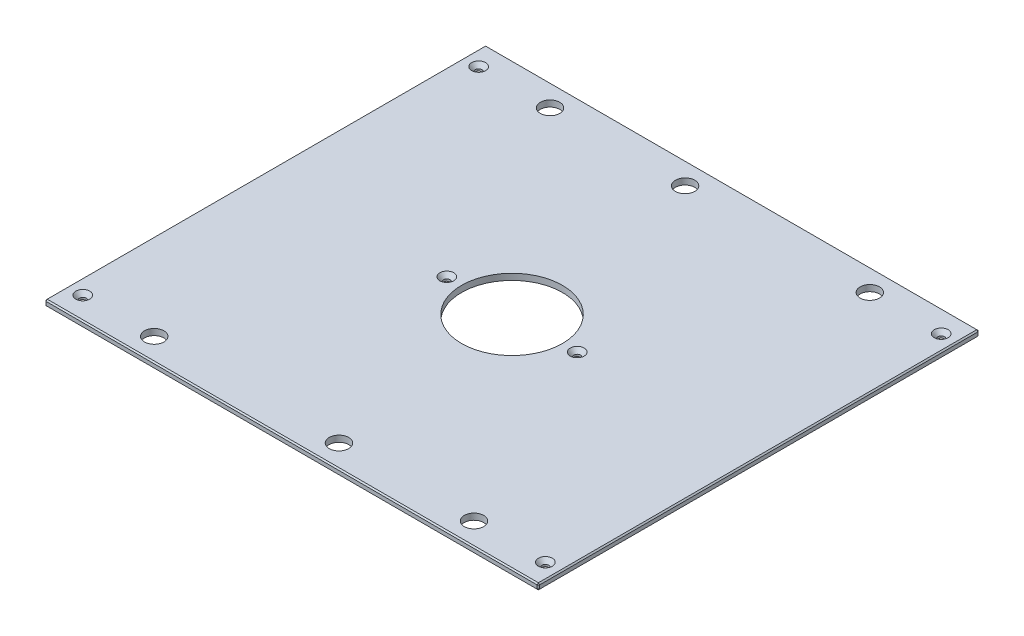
from build123d import *

# Parameters (mm, degrees)
SKETCH1_W                                     = 504.825
SKETCH1_H                                     = 450.85
BOSS_EXTRUDE1_DEPTH                           = 6.35
SKETCH13_R                                    = 51.562
CUT_EXTRUDE6_DEPTH                            = 339.480166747
F_25_32_0_78125_DIAMETER_HOLE1_D              = 19.84375
CHAMFER2_SIZE                                 = 1.27
CSK_FOR_1_4_FLAT_HEAD_MACHINE_SCREW1_AT_COUNT = 2
CSK_FOR_1_4_FLAT_HEAD_MACHINE_SCREW1_AT_PITCH = 404.80996
CSK_FOR_1_4_FLAT_HEAD_MACHINE_SCREW1_2_COUNT  = 2
CSK_FOR_1_4_FLAT_HEAD_MACHINE_SCREW1_2_PITCH  = 622.632362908
CSK_FOR_1_4_FLAT_HEAD_MACHINE_SCREW1_3_COUNT  = 2
CSK_FOR_1_4_FLAT_HEAD_MACHINE_SCREW1_3_PITCH  = 364.562197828
CSK_FOR_1_4_FLAT_HEAD_MACHINE_SCREW1_4_COUNT  = 2
CSK_FOR_1_4_FLAT_HEAD_MACHINE_SCREW1_4_PITCH  = 264.236721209
CSK_FOR_1_4_FLAT_HEAD_MACHINE_SCREW1_5_COUNT  = 2
CSK_FOR_1_4_FLAT_HEAD_MACHINE_SCREW1_5_PITCH  = 473.075
CSK_FOR_1_4_FLAT_HEAD_MACHINE_SCREW1_6_COUNT  = 2
CSK_FOR_1_4_FLAT_HEAD_MACHINE_SCREW1_6_PITCH  = 400.05
CSK_FOR_1_4_FLAT_HEAD_MACHINE_SCREW1_7_COUNT  = 2
CSK_FOR_1_4_FLAT_HEAD_MACHINE_SCREW1_7_PITCH  = 569.131888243


with BuildPart() as part:
    # Sketch1 → Boss-Extrude1 (new body)
    with BuildSketch(Plane(origin=(0, 0, 0), x_dir=(1, 0, 0), z_dir=(0, 1, 0))):
        Rectangle(SKETCH1_W, SKETCH1_H)
    extrude(amount=BOSS_EXTRUDE1_DEPTH)

    # Sketch13 → Cut-Extrude6 (cut, through all)
    with BuildSketch(Plane(origin=(0, 6.35, 0), x_dir=(1, 0, 0), z_dir=(0, 1, 0))):
        with Locations(Location((0, 0, 0), (0, 0, 270))):
            Circle(SKETCH13_R)
    extrude(amount=-CUT_EXTRUDE6_DEPTH, mode=Mode.SUBTRACT)

    # 25_32 _0.78125_ Diameter Hole1 (through all)
    with Locations(Plane(origin=(0, 6.35, 0), x_dir=(1, 0, 0), z_dir=(0, 1, 0))):
        with Locations((163.5125, 202.40498), (-163.5125, 202.40498), (163.5125, -202.40498), (-163.5125, -202.40498), (-25.4, 202.40498), (25.4, -202.40498)):
            Hole(F_25_32_0_78125_DIAMETER_HOLE1_D / 2)

    # Chamfer2
    chamfer2_edges = [part.edges().sort_by_distance(p)[0] for p in [
        (252.4125, 6.35, 0),
        (0, 6.35, -225.425),
        (-252.4125, 6.35, 0),
        (0, 0, -225.425),
        (252.4125, 0, 0),
        (0, 0, 225.425),
        (-252.4125, 0, 0),
        (0, 6.35, 225.425),
        (-252.4125, 3.175, -225.425),
        (252.4125, 3.175, -225.425),
        (252.4125, 3.175, 225.425),
        (-252.4125, 3.175, 225.425),
    ]]
    chamfer(chamfer2_edges, length=CHAMFER2_SIZE)

    # Sketch24 → CSK for 1_4 Flat Head Machine Screw1 (revolve, cut)
    with BuildSketch(Plane(origin=(236.5375, 6.35, -202.40498), x_dir=(0, 0, 1), z_dir=(1, 0, 0))):
        Polygon((0, 0), (0, 6.35), (3.3782, 6.35), (3.3782, 4.324464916), (7.1374, 0), align=None)
    csk_for_1_4_flat_head_machine_screw1 = revolve(axis=Axis((236.5375, 12.7, -202.40498), (0, -1, 0)), mode=Mode.SUBTRACT)

    # CSK for 1_4 Flat Head Machine Screw1 at: CSK for 1_4 Flat Head Machine Screw1 ×2
    with Locations(*[(0, 0, i * CSK_FOR_1_4_FLAT_HEAD_MACHINE_SCREW1_AT_PITCH) for i in range(1, CSK_FOR_1_4_FLAT_HEAD_MACHINE_SCREW1_AT_COUNT)]):
        add(csk_for_1_4_flat_head_machine_screw1, mode=Mode.SUBTRACT)

    # CSK for 1_4 Flat Head Machine Screw1 2: CSK for 1_4 Flat Head Machine Screw1 ×2
    with Locations(*[Vector(-0.7597982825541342, 0, 0.6501588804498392) * (i * CSK_FOR_1_4_FLAT_HEAD_MACHINE_SCREW1_2_PITCH) for i in range(1, CSK_FOR_1_4_FLAT_HEAD_MACHINE_SCREW1_2_COUNT)]):
        add(csk_for_1_4_flat_head_machine_screw1, mode=Mode.SUBTRACT)

    # CSK for 1_4 Flat Head Machine Screw1 3: CSK for 1_4 Flat Head Machine Screw1 ×2
    with Locations(*[Vector(-0.831716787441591, 0, 0.5552001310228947) * (i * CSK_FOR_1_4_FLAT_HEAD_MACHINE_SCREW1_3_PITCH) for i in range(1, CSK_FOR_1_4_FLAT_HEAD_MACHINE_SCREW1_3_COUNT)]):
        add(csk_for_1_4_flat_head_machine_screw1, mode=Mode.SUBTRACT)

    # CSK for 1_4 Flat Head Machine Screw1 4: CSK for 1_4 Flat Head Machine Screw1 ×2
    with Locations(*[Vector(-0.6428421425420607, 0, 0.7659986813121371) * (i * CSK_FOR_1_4_FLAT_HEAD_MACHINE_SCREW1_4_PITCH) for i in range(1, CSK_FOR_1_4_FLAT_HEAD_MACHINE_SCREW1_4_COUNT)]):
        add(csk_for_1_4_flat_head_machine_screw1, mode=Mode.SUBTRACT)

    # CSK for 1_4 Flat Head Machine Screw1 5: CSK for 1_4 Flat Head Machine Screw1 ×2
    with Locations(*[(-i * CSK_FOR_1_4_FLAT_HEAD_MACHINE_SCREW1_5_PITCH, 0, 0) for i in range(1, CSK_FOR_1_4_FLAT_HEAD_MACHINE_SCREW1_5_COUNT)]):
        add(csk_for_1_4_flat_head_machine_screw1, mode=Mode.SUBTRACT)

    # CSK for 1_4 Flat Head Machine Screw1 6: CSK for 1_4 Flat Head Machine Screw1 ×2
    with Locations(*[(-i * CSK_FOR_1_4_FLAT_HEAD_MACHINE_SCREW1_6_PITCH, 0, 0) for i in range(1, CSK_FOR_1_4_FLAT_HEAD_MACHINE_SCREW1_6_COUNT)]):
        add(csk_for_1_4_flat_head_machine_screw1, mode=Mode.SUBTRACT)

    # CSK for 1_4 Flat Head Machine Screw1 7: CSK for 1_4 Flat Head Machine Screw1 ×2
    with Locations(*[Vector(-0.7029126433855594, 0, 0.7112761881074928) * (i * CSK_FOR_1_4_FLAT_HEAD_MACHINE_SCREW1_7_PITCH) for i in range(1, CSK_FOR_1_4_FLAT_HEAD_MACHINE_SCREW1_7_COUNT)]):
        add(csk_for_1_4_flat_head_machine_screw1, mode=Mode.SUBTRACT)


solid = part.part
